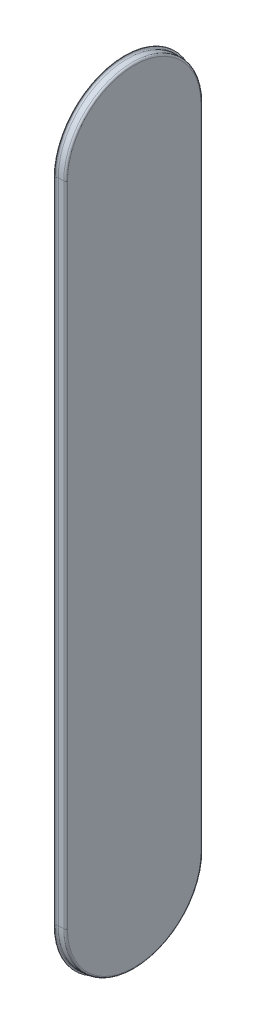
ISO-10303-21;
HEADER;
FILE_DESCRIPTION(('STEP AP214'),'2;1');
FILE_NAME('part.step','',(''),(''),'','','');
FILE_SCHEMA(('AUTOMOTIVE_DESIGN { 1 0 10303 214 1 1 1 1 }'));
ENDSEC;
DATA;
#1=APPLICATION_CONTEXT('core data for automotive mechanical design processes');
#2=APPLICATION_PROTOCOL_DEFINITION('international standard','automotive_design',2000,#1);
#3=PRODUCT_CONTEXT('',#1,'mechanical');
#4=PRODUCT('Part','Part','',(#3));
#5=PRODUCT_RELATED_PRODUCT_CATEGORY('part','',(#4));
#6=PRODUCT_DEFINITION_FORMATION('','',#4);
#7=PRODUCT_DEFINITION_CONTEXT('part definition',#1,'design');
#8=PRODUCT_DEFINITION('design','',#6,#7);
#9=PRODUCT_DEFINITION_SHAPE('','',#8);
#10=(LENGTH_UNIT() NAMED_UNIT(*) SI_UNIT(.MILLI.,.METRE.));
#11=(NAMED_UNIT(*) PLANE_ANGLE_UNIT() SI_UNIT($,.RADIAN.));
#12=(NAMED_UNIT(*) SI_UNIT($,.STERADIAN.) SOLID_ANGLE_UNIT());
#13=UNCERTAINTY_MEASURE_WITH_UNIT(LENGTH_MEASURE(1.E-05),#10,'distance_accuracy_value','');
#14=(GEOMETRIC_REPRESENTATION_CONTEXT(3) GLOBAL_UNCERTAINTY_ASSIGNED_CONTEXT((#13)) GLOBAL_UNIT_ASSIGNED_CONTEXT((#10,
#11,#12)) REPRESENTATION_CONTEXT('',''));
#15=CARTESIAN_POINT('',(0.,0.,0.));
#16=DIRECTION('',(0.,0.,1.));
#17=DIRECTION('',(1.,0.,0.));
#18=AXIS2_PLACEMENT_3D('',#15,#16,#17);
#19=CARTESIAN_POINT('',(-38.75,-31.965,3.99999999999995));
#20=DIRECTION('',(-1.,0.,0.));
#21=DIRECTION('',(0.,-1.,0.));
#22=AXIS2_PLACEMENT_3D('',#19,#20,#21);
#23=PLANE('',#22);
#24=DIRECTION('',(0.,1.,0.));
#25=VECTOR('',#24,1.);
#26=CARTESIAN_POINT('',(-38.75,-31.965,5.82499999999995));
#27=LINE('',#26,#25);
#28=CARTESIAN_POINT('',(-38.75,-31.965,5.82499999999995));
#29=VERTEX_POINT('',#28);
#30=CARTESIAN_POINT('',(-38.75,-14.265,5.82499999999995));
#31=VERTEX_POINT('',#30);
#32=EDGE_CURVE('E164',#29,#31,#27,.T.);
#33=ORIENTED_EDGE('',*,*,#32,.F.);
#34=CARTESIAN_POINT('',(-38.75,-31.965,3.99999999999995));
#35=DIRECTION('',(-1.,0.,0.));
#36=DIRECTION('',(0.,0.,-1.));
#37=AXIS2_PLACEMENT_3D('',#34,#35,#36);
#38=CIRCLE('',#37,1.825);
#39=CARTESIAN_POINT('',(-38.75,-31.965,2.17499999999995));
#40=VERTEX_POINT('',#39);
#41=EDGE_CURVE('E145',#40,#29,#38,.T.);
#42=ORIENTED_EDGE('',*,*,#41,.F.);
#43=DIRECTION('',(0.,-1.,0.));
#44=VECTOR('',#43,1.);
#45=CARTESIAN_POINT('',(-38.75,-31.965,2.17499999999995));
#46=LINE('',#45,#44);
#47=CARTESIAN_POINT('',(-38.75,-14.265,2.17499999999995));
#48=VERTEX_POINT('',#47);
#49=EDGE_CURVE('E144',#48,#40,#46,.T.);
#50=ORIENTED_EDGE('',*,*,#49,.F.);
#51=CARTESIAN_POINT('',(-38.75,-14.265,3.99999999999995));
#52=DIRECTION('',(-1.,0.,0.));
#53=DIRECTION('',(0.,0.,1.));
#54=AXIS2_PLACEMENT_3D('',#51,#52,#53);
#55=CIRCLE('',#54,1.825);
#56=EDGE_CURVE('E130',#31,#48,#55,.T.);
#57=ORIENTED_EDGE('',*,*,#56,.F.);
#58=EDGE_LOOP('',(#33,#42,#50,#57));
#59=FACE_BOUND('',#58,.T.);
#60=ADVANCED_FACE('F17',(#59),#23,.F.);
#61=CARTESIAN_POINT('',(-38.8,-14.265,3.99999999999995));
#62=DIRECTION('',(-1.,0.,0.));
#63=DIRECTION('',(0.,1.,0.));
#64=AXIS2_PLACEMENT_3D('',#61,#62,#63);
#65=TOROIDAL_SURFACE('',#64,1.825,0.05);
#66=CARTESIAN_POINT('',(-38.8,-14.265,2.17499999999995));
#67=DIRECTION('',(0.,-1.,0.));
#68=DIRECTION('',(1.,0.,0.));
#69=AXIS2_PLACEMENT_3D('',#66,#67,#68);
#70=CIRCLE('',#69,0.0500000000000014);
#71=CARTESIAN_POINT('',(-38.8,-14.265,2.12499999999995));
#72=VERTEX_POINT('',#71);
#73=EDGE_CURVE('E134',#72,#48,#70,.T.);
#74=ORIENTED_EDGE('',*,*,#73,.F.);
#75=CARTESIAN_POINT('',(-38.8,-14.265,3.99999999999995));
#76=DIRECTION('',(-1.,0.,0.));
#77=DIRECTION('',(0.,-1.,0.));
#78=AXIS2_PLACEMENT_3D('',#75,#76,#77);
#79=CIRCLE('',#78,1.875);
#80=CARTESIAN_POINT('',(-38.8,-14.265,5.87499999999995));
#81=VERTEX_POINT('',#80);
#82=EDGE_CURVE('E237',#81,#72,#79,.T.);
#83=ORIENTED_EDGE('',*,*,#82,.F.);
#84=CARTESIAN_POINT('',(-38.8,-14.265,5.82499999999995));
#85=DIRECTION('',(0.,1.,0.));
#86=DIRECTION('',(-1.,0.,0.));
#87=AXIS2_PLACEMENT_3D('',#84,#85,#86);
#88=CIRCLE('',#87,0.0500000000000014);
#89=EDGE_CURVE('E137',#31,#81,#88,.F.);
#90=ORIENTED_EDGE('',*,*,#89,.F.);
#91=ORIENTED_EDGE('',*,*,#56,.T.);
#92=EDGE_LOOP('',(#74,#83,#90,#91));
#93=FACE_BOUND('',#92,.T.);
#94=ADVANCED_FACE('F132',(#93),#65,.T.);
#95=CARTESIAN_POINT('',(-38.8,-31.965,2.17499999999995));
#96=DIRECTION('',(0.,-1.,0.));
#97=DIRECTION('',(1.,0.,0.));
#98=AXIS2_PLACEMENT_3D('',#95,#96,#97);
#99=CYLINDRICAL_SURFACE('',#98,0.0500000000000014);
#100=CARTESIAN_POINT('',(-38.8,-31.965,2.17499999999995));
#101=DIRECTION('',(0.,-1.,0.));
#102=DIRECTION('',(0.,0.,-1.));
#103=AXIS2_PLACEMENT_3D('',#100,#101,#102);
#104=CIRCLE('',#103,0.05);
#105=CARTESIAN_POINT('',(-38.8,-31.965,2.12499999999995));
#106=VERTEX_POINT('',#105);
#107=EDGE_CURVE('E183',#106,#40,#104,.T.);
#108=ORIENTED_EDGE('',*,*,#107,.F.);
#109=DIRECTION('',(0.,1.,0.));
#110=VECTOR('',#109,1.);
#111=CARTESIAN_POINT('',(-38.8,-31.965,2.12499999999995));
#112=LINE('',#111,#110);
#113=EDGE_CURVE('E153',#72,#106,#112,.F.);
#114=ORIENTED_EDGE('',*,*,#113,.F.);
#115=ORIENTED_EDGE('',*,*,#73,.T.);
#116=ORIENTED_EDGE('',*,*,#49,.T.);
#117=EDGE_LOOP('',(#108,#114,#115,#116));
#118=FACE_BOUND('',#117,.T.);
#119=ADVANCED_FACE('F151',(#118),#99,.T.);
#120=CARTESIAN_POINT('',(-38.8,-31.965,3.99999999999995));
#121=DIRECTION('',(-1.,0.,0.));
#122=DIRECTION('',(0.,-1.,0.));
#123=AXIS2_PLACEMENT_3D('',#120,#121,#122);
#124=TOROIDAL_SURFACE('',#123,1.825,0.05);
#125=CARTESIAN_POINT('',(-38.8,-31.965,3.99999999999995));
#126=DIRECTION('',(-1.,0.,0.));
#127=DIRECTION('',(0.,-1.,0.));
#128=AXIS2_PLACEMENT_3D('',#125,#126,#127);
#129=CIRCLE('',#128,1.875);
#130=CARTESIAN_POINT('',(-38.8,-31.965,5.87499999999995));
#131=VERTEX_POINT('',#130);
#132=EDGE_CURVE('E212',#106,#131,#129,.T.);
#133=ORIENTED_EDGE('',*,*,#132,.F.);
#134=ORIENTED_EDGE('',*,*,#107,.T.);
#135=ORIENTED_EDGE('',*,*,#41,.T.);
#136=CARTESIAN_POINT('',(-38.8,-31.965,5.82499999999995));
#137=DIRECTION('',(0.,1.,0.));
#138=DIRECTION('',(-1.,0.,0.));
#139=AXIS2_PLACEMENT_3D('',#136,#137,#138);
#140=CIRCLE('',#139,0.0500000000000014);
#141=EDGE_CURVE('E184',#131,#29,#140,.T.);
#142=ORIENTED_EDGE('',*,*,#141,.F.);
#143=EDGE_LOOP('',(#133,#134,#135,#142));
#144=FACE_BOUND('',#143,.T.);
#145=ADVANCED_FACE('F171',(#144),#124,.T.);
#146=CARTESIAN_POINT('',(-38.8,-31.965,5.82499999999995));
#147=DIRECTION('',(0.,1.,0.));
#148=DIRECTION('',(-1.,0.,0.));
#149=AXIS2_PLACEMENT_3D('',#146,#147,#148);
#150=CYLINDRICAL_SURFACE('',#149,0.0500000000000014);
#151=ORIENTED_EDGE('',*,*,#89,.T.);
#152=DIRECTION('',(0.,1.,0.));
#153=VECTOR('',#152,1.);
#154=CARTESIAN_POINT('',(-38.8,-31.965,5.87499999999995));
#155=LINE('',#154,#153);
#156=EDGE_CURVE('E194',#131,#81,#155,.T.);
#157=ORIENTED_EDGE('',*,*,#156,.F.);
#158=ORIENTED_EDGE('',*,*,#141,.T.);
#159=ORIENTED_EDGE('',*,*,#32,.T.);
#160=EDGE_LOOP('',(#151,#157,#158,#159));
#161=FACE_BOUND('',#160,.T.);
#162=ADVANCED_FACE('F176',(#161),#150,.T.);
#163=CARTESIAN_POINT('',(-38.75,-14.265,3.99999999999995));
#164=DIRECTION('',(-1.,0.,0.));
#165=DIRECTION('',(0.,-1.,0.));
#166=AXIS2_PLACEMENT_3D('',#163,#164,#165);
#167=CYLINDRICAL_SURFACE('',#166,1.875);
#168=DIRECTION('',(-1.,0.,0.));
#169=VECTOR('',#168,1.);
#170=CARTESIAN_POINT('',(-38.75,-14.265,2.12499999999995));
#171=LINE('',#170,#169);
#172=CARTESIAN_POINT('',(-38.95,-14.265,2.12499999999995));
#173=VERTEX_POINT('',#172);
#174=EDGE_CURVE('E235',#173,#72,#171,.F.);
#175=ORIENTED_EDGE('',*,*,#174,.F.);
#176=CARTESIAN_POINT('',(-38.95,-14.265,3.99999999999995));
#177=DIRECTION('',(-1.,0.,0.));
#178=DIRECTION('',(0.,1.,0.));
#179=AXIS2_PLACEMENT_3D('',#176,#177,#178);
#180=CIRCLE('',#179,1.875);
#181=CARTESIAN_POINT('',(-38.95,-14.265,5.87499999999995));
#182=VERTEX_POINT('',#181);
#183=EDGE_CURVE('E221',#173,#182,#180,.F.);
#184=ORIENTED_EDGE('',*,*,#183,.T.);
#185=DIRECTION('',(1.,0.,0.));
#186=VECTOR('',#185,1.);
#187=CARTESIAN_POINT('',(-38.75,-14.265,5.87499999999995));
#188=LINE('',#187,#186);
#189=EDGE_CURVE('E199',#81,#182,#188,.F.);
#190=ORIENTED_EDGE('',*,*,#189,.F.);
#191=ORIENTED_EDGE('',*,*,#82,.T.);
#192=EDGE_LOOP('',(#175,#184,#190,#191));
#193=FACE_BOUND('',#192,.T.);
#194=ADVANCED_FACE('F299',(#193),#167,.T.);
#195=CARTESIAN_POINT('',(-38.75,-31.965,2.12499999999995));
#196=DIRECTION('',(0.,0.,-1.));
#197=DIRECTION('',(-1.,0.,0.));
#198=AXIS2_PLACEMENT_3D('',#195,#196,#197);
#199=PLANE('',#198);
#200=DIRECTION('',(-1.,0.,0.));
#201=VECTOR('',#200,1.);
#202=CARTESIAN_POINT('',(-38.75,-31.965,2.12499999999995));
#203=LINE('',#202,#201);
#204=CARTESIAN_POINT('',(-38.95,-31.965,2.12499999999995));
#205=VERTEX_POINT('',#204);
#206=EDGE_CURVE('E209',#205,#106,#203,.F.);
#207=ORIENTED_EDGE('',*,*,#206,.F.);
#208=DIRECTION('',(0.,1.,0.));
#209=VECTOR('',#208,1.);
#210=CARTESIAN_POINT('',(-38.95,-31.965,2.12499999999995));
#211=LINE('',#210,#209);
#212=EDGE_CURVE('E225',#205,#173,#211,.T.);
#213=ORIENTED_EDGE('',*,*,#212,.T.);
#214=ORIENTED_EDGE('',*,*,#174,.T.);
#215=ORIENTED_EDGE('',*,*,#113,.T.);
#216=EDGE_LOOP('',(#207,#213,#214,#215));
#217=FACE_BOUND('',#216,.T.);
#218=ADVANCED_FACE('F253',(#217),#199,.T.);
#219=CARTESIAN_POINT('',(-38.75,-31.965,3.99999999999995));
#220=DIRECTION('',(-1.,0.,0.));
#221=DIRECTION('',(0.,-1.,0.));
#222=AXIS2_PLACEMENT_3D('',#219,#220,#221);
#223=CYLINDRICAL_SURFACE('',#222,1.875);
#224=CARTESIAN_POINT('',(-38.95,-31.965,3.99999999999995));
#225=DIRECTION('',(-1.,0.,0.));
#226=DIRECTION('',(0.,-1.,0.));
#227=AXIS2_PLACEMENT_3D('',#224,#225,#226);
#228=CIRCLE('',#227,1.875);
#229=CARTESIAN_POINT('',(-38.95,-31.965,5.87499999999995));
#230=VERTEX_POINT('',#229);
#231=EDGE_CURVE('E255',#230,#205,#228,.F.);
#232=ORIENTED_EDGE('',*,*,#231,.T.);
#233=ORIENTED_EDGE('',*,*,#206,.T.);
#234=ORIENTED_EDGE('',*,*,#132,.T.);
#235=DIRECTION('',(1.,0.,0.));
#236=VECTOR('',#235,1.);
#237=CARTESIAN_POINT('',(-38.75,-31.965,5.87499999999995));
#238=LINE('',#237,#236);
#239=EDGE_CURVE('E200',#230,#131,#238,.T.);
#240=ORIENTED_EDGE('',*,*,#239,.F.);
#241=EDGE_LOOP('',(#232,#233,#234,#240));
#242=FACE_BOUND('',#241,.T.);
#243=ADVANCED_FACE('F254',(#242),#223,.T.);
#244=CARTESIAN_POINT('',(-38.75,-31.965,5.87499999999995));
#245=DIRECTION('',(0.,0.,1.));
#246=DIRECTION('',(1.,0.,0.));
#247=AXIS2_PLACEMENT_3D('',#244,#245,#246);
#248=PLANE('',#247);
#249=ORIENTED_EDGE('',*,*,#189,.T.);
#250=DIRECTION('',(0.,-1.,0.));
#251=VECTOR('',#250,1.);
#252=CARTESIAN_POINT('',(-38.95,-31.965,5.87499999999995));
#253=LINE('',#252,#251);
#254=EDGE_CURVE('E205',#182,#230,#253,.T.);
#255=ORIENTED_EDGE('',*,*,#254,.T.);
#256=ORIENTED_EDGE('',*,*,#239,.T.);
#257=ORIENTED_EDGE('',*,*,#156,.T.);
#258=EDGE_LOOP('',(#249,#255,#256,#257));
#259=FACE_BOUND('',#258,.T.);
#260=ADVANCED_FACE('F203',(#259),#248,.T.);
#261=CARTESIAN_POINT('',(-38.95,-14.265,3.99999999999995));
#262=DIRECTION('',(-1.,0.,0.));
#263=DIRECTION('',(0.,1.,0.));
#264=AXIS2_PLACEMENT_3D('',#261,#262,#263);
#265=TOROIDAL_SURFACE('',#264,1.925,0.05);
#266=ORIENTED_EDGE('',*,*,#183,.F.);
#267=CARTESIAN_POINT('',(-38.95,-14.265,2.07499999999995));
#268=DIRECTION('',(0.,1.,0.));
#269=DIRECTION('',(-1.,0.,0.));
#270=AXIS2_PLACEMENT_3D('',#267,#268,#269);
#271=CIRCLE('',#270,0.0500000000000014);
#272=CARTESIAN_POINT('',(-39.,-14.265,2.07499999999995));
#273=VERTEX_POINT('',#272);
#274=EDGE_CURVE('E230',#173,#273,#271,.F.);
#275=ORIENTED_EDGE('',*,*,#274,.T.);
#276=CARTESIAN_POINT('',(-39.,-14.265,3.99999999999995));
#277=DIRECTION('',(-1.,0.,0.));
#278=DIRECTION('',(0.,-1.,0.));
#279=AXIS2_PLACEMENT_3D('',#276,#277,#278);
#280=CIRCLE('',#279,1.925);
#281=CARTESIAN_POINT('',(-39.,-14.265,5.92499999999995));
#282=VERTEX_POINT('',#281);
#283=EDGE_CURVE('E527',#282,#273,#280,.T.);
#284=ORIENTED_EDGE('',*,*,#283,.F.);
#285=CARTESIAN_POINT('',(-38.95,-14.265,5.92499999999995));
#286=DIRECTION('',(0.,-1.,0.));
#287=DIRECTION('',(1.,0.,0.));
#288=AXIS2_PLACEMENT_3D('',#285,#286,#287);
#289=CIRCLE('',#288,0.0500000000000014);
#290=EDGE_CURVE('E272',#282,#182,#289,.T.);
#291=ORIENTED_EDGE('',*,*,#290,.T.);
#292=EDGE_LOOP('',(#266,#275,#284,#291));
#293=FACE_BOUND('',#292,.T.);
#294=ADVANCED_FACE('F288',(#293),#265,.F.);
#295=CARTESIAN_POINT('',(-38.95,-31.965,2.07499999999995));
#296=DIRECTION('',(0.,1.,0.));
#297=DIRECTION('',(-1.,0.,0.));
#298=AXIS2_PLACEMENT_3D('',#295,#296,#297);
#299=CYLINDRICAL_SURFACE('',#298,0.0500000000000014);
#300=ORIENTED_EDGE('',*,*,#212,.F.);
#301=CARTESIAN_POINT('',(-38.95,-31.965,2.07499999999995));
#302=DIRECTION('',(0.,-1.,0.));
#303=DIRECTION('',(0.,0.,-1.));
#304=AXIS2_PLACEMENT_3D('',#301,#302,#303);
#305=CIRCLE('',#304,0.05);
#306=CARTESIAN_POINT('',(-39.,-31.965,2.07499999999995));
#307=VERTEX_POINT('',#306);
#308=EDGE_CURVE('E260',#205,#307,#305,.T.);
#309=ORIENTED_EDGE('',*,*,#308,.T.);
#310=DIRECTION('',(0.,1.,0.));
#311=VECTOR('',#310,1.);
#312=CARTESIAN_POINT('',(-39.,-23.115,2.07499999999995));
#313=LINE('',#312,#311);
#314=EDGE_CURVE('E524',#307,#273,#313,.T.);
#315=ORIENTED_EDGE('',*,*,#314,.T.);
#316=ORIENTED_EDGE('',*,*,#274,.F.);
#317=EDGE_LOOP('',(#300,#309,#315,#316));
#318=FACE_BOUND('',#317,.T.);
#319=ADVANCED_FACE('F264',(#318),#299,.F.);
#320=CARTESIAN_POINT('',(-38.95,-31.965,3.99999999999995));
#321=DIRECTION('',(-1.,0.,0.));
#322=DIRECTION('',(0.,-1.,0.));
#323=AXIS2_PLACEMENT_3D('',#320,#321,#322);
#324=TOROIDAL_SURFACE('',#323,1.925,0.05);
#325=ORIENTED_EDGE('',*,*,#308,.F.);
#326=ORIENTED_EDGE('',*,*,#231,.F.);
#327=CARTESIAN_POINT('',(-38.95,-31.965,5.92499999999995));
#328=DIRECTION('',(0.,-1.,0.));
#329=DIRECTION('',(1.,0.,0.));
#330=AXIS2_PLACEMENT_3D('',#327,#328,#329);
#331=CIRCLE('',#330,0.0500000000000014);
#332=CARTESIAN_POINT('',(-39.,-31.965,5.92499999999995));
#333=VERTEX_POINT('',#332);
#334=EDGE_CURVE('E530',#230,#333,#331,.F.);
#335=ORIENTED_EDGE('',*,*,#334,.T.);
#336=CARTESIAN_POINT('',(-39.,-31.965,3.99999999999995));
#337=DIRECTION('',(-1.,0.,0.));
#338=DIRECTION('',(0.,-1.,0.));
#339=AXIS2_PLACEMENT_3D('',#336,#337,#338);
#340=CIRCLE('',#339,1.925);
#341=EDGE_CURVE('E270',#307,#333,#340,.T.);
#342=ORIENTED_EDGE('',*,*,#341,.F.);
#343=EDGE_LOOP('',(#325,#326,#335,#342));
#344=FACE_BOUND('',#343,.T.);
#345=ADVANCED_FACE('F268',(#344),#324,.F.);
#346=CARTESIAN_POINT('',(-38.95,-31.965,5.92499999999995));
#347=DIRECTION('',(0.,-1.,0.));
#348=DIRECTION('',(1.,0.,0.));
#349=AXIS2_PLACEMENT_3D('',#346,#347,#348);
#350=CYLINDRICAL_SURFACE('',#349,0.0500000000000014);
#351=ORIENTED_EDGE('',*,*,#254,.F.);
#352=ORIENTED_EDGE('',*,*,#290,.F.);
#353=DIRECTION('',(0.,1.,0.));
#354=VECTOR('',#353,1.);
#355=CARTESIAN_POINT('',(-39.,-23.115,5.92499999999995));
#356=LINE('',#355,#354);
#357=EDGE_CURVE('E491',#282,#333,#356,.F.);
#358=ORIENTED_EDGE('',*,*,#357,.T.);
#359=ORIENTED_EDGE('',*,*,#334,.F.);
#360=EDGE_LOOP('',(#351,#352,#358,#359));
#361=FACE_BOUND('',#360,.T.);
#362=ADVANCED_FACE('F566',(#361),#350,.F.);
#363=CARTESIAN_POINT('',(-38.95,-14.265,3.99999999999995));
#364=DIRECTION('',(-1.,0.,0.));
#365=DIRECTION('',(0.,-1.,0.));
#366=AXIS2_PLACEMENT_3D('',#363,#364,#365);
#367=CYLINDRICAL_SURFACE('',#366,1.925);
#368=DIRECTION('',(1.,0.,0.));
#369=VECTOR('',#368,1.);
#370=CARTESIAN_POINT('',(-39.01,-14.265,2.07499999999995));
#371=LINE('',#370,#369);
#372=CARTESIAN_POINT('',(-39.01,-14.265,2.07499999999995));
#373=VERTEX_POINT('',#372);
#374=EDGE_CURVE('E522',#273,#373,#371,.F.);
#375=ORIENTED_EDGE('',*,*,#374,.T.);
#376=CARTESIAN_POINT('',(-39.01,-14.265,3.99999999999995));
#377=DIRECTION('',(-1.,0.,0.));
#378=DIRECTION('',(0.,1.,0.));
#379=AXIS2_PLACEMENT_3D('',#376,#377,#378);
#380=CIRCLE('',#379,1.925);
#381=CARTESIAN_POINT('',(-39.01,-14.265,5.92499999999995));
#382=VERTEX_POINT('',#381);
#383=EDGE_CURVE('E487',#382,#373,#380,.T.);
#384=ORIENTED_EDGE('',*,*,#383,.F.);
#385=DIRECTION('',(-1.,0.,0.));
#386=VECTOR('',#385,1.);
#387=CARTESIAN_POINT('',(-39.01,-14.265,5.92499999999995));
#388=LINE('',#387,#386);
#389=EDGE_CURVE('E498',#382,#282,#388,.F.);
#390=ORIENTED_EDGE('',*,*,#389,.T.);
#391=ORIENTED_EDGE('',*,*,#283,.T.);
#392=EDGE_LOOP('',(#375,#384,#390,#391));
#393=FACE_BOUND('',#392,.T.);
#394=ADVANCED_FACE('F549',(#393),#367,.T.);
#395=CARTESIAN_POINT('',(-39.01,-23.115,2.07499999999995));
#396=DIRECTION('',(0.,0.,1.));
#397=DIRECTION('',(1.,0.,0.));
#398=AXIS2_PLACEMENT_3D('',#395,#396,#397);
#399=PLANE('',#398);
#400=ORIENTED_EDGE('',*,*,#314,.F.);
#401=DIRECTION('',(-1.,0.,0.));
#402=VECTOR('',#401,1.);
#403=CARTESIAN_POINT('',(-38.95,-31.965,2.07499999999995));
#404=LINE('',#403,#402);
#405=CARTESIAN_POINT('',(-39.01,-31.965,2.07499999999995));
#406=VERTEX_POINT('',#405);
#407=EDGE_CURVE('E505',#406,#307,#404,.F.);
#408=ORIENTED_EDGE('',*,*,#407,.F.);
#409=DIRECTION('',(0.,1.,0.));
#410=VECTOR('',#409,1.);
#411=CARTESIAN_POINT('',(-39.01,-31.965,2.07499999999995));
#412=LINE('',#411,#410);
#413=EDGE_CURVE('E511',#373,#406,#412,.F.);
#414=ORIENTED_EDGE('',*,*,#413,.F.);
#415=ORIENTED_EDGE('',*,*,#374,.F.);
#416=EDGE_LOOP('',(#400,#408,#414,#415));
#417=FACE_BOUND('',#416,.T.);
#418=ADVANCED_FACE('F553',(#417),#399,.F.);
#419=CARTESIAN_POINT('',(-38.95,-31.965,3.99999999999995));
#420=DIRECTION('',(-1.,0.,0.));
#421=DIRECTION('',(0.,-1.,0.));
#422=AXIS2_PLACEMENT_3D('',#419,#420,#421);
#423=CYLINDRICAL_SURFACE('',#422,1.925);
#424=CARTESIAN_POINT('',(-39.01,-31.965,3.99999999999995));
#425=DIRECTION('',(-1.,0.,0.));
#426=DIRECTION('',(0.,-1.,0.));
#427=AXIS2_PLACEMENT_3D('',#424,#425,#426);
#428=CIRCLE('',#427,1.925);
#429=CARTESIAN_POINT('',(-39.01,-31.965,5.92499999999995));
#430=VERTEX_POINT('',#429);
#431=EDGE_CURVE('E508',#406,#430,#428,.T.);
#432=ORIENTED_EDGE('',*,*,#431,.F.);
#433=ORIENTED_EDGE('',*,*,#407,.T.);
#434=ORIENTED_EDGE('',*,*,#341,.T.);
#435=DIRECTION('',(-1.,0.,0.));
#436=VECTOR('',#435,1.);
#437=CARTESIAN_POINT('',(-39.01,-31.965,5.92499999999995));
#438=LINE('',#437,#436);
#439=EDGE_CURVE('E501',#333,#430,#438,.T.);
#440=ORIENTED_EDGE('',*,*,#439,.T.);
#441=EDGE_LOOP('',(#432,#433,#434,#440));
#442=FACE_BOUND('',#441,.T.);
#443=ADVANCED_FACE('F569',(#442),#423,.T.);
#444=CARTESIAN_POINT('',(-39.01,-23.115,5.92499999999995));
#445=DIRECTION('',(0.,0.,-1.));
#446=DIRECTION('',(-1.,0.,0.));
#447=AXIS2_PLACEMENT_3D('',#444,#445,#446);
#448=PLANE('',#447);
#449=ORIENTED_EDGE('',*,*,#389,.F.);
#450=DIRECTION('',(0.,-1.,0.));
#451=VECTOR('',#450,1.);
#452=CARTESIAN_POINT('',(-39.01,-31.965,5.92499999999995));
#453=LINE('',#452,#451);
#454=EDGE_CURVE('E443',#430,#382,#453,.F.);
#455=ORIENTED_EDGE('',*,*,#454,.F.);
#456=ORIENTED_EDGE('',*,*,#439,.F.);
#457=ORIENTED_EDGE('',*,*,#357,.F.);
#458=EDGE_LOOP('',(#449,#455,#456,#457));
#459=FACE_BOUND('',#458,.T.);
#460=ADVANCED_FACE('F479',(#459),#448,.F.);
#461=CARTESIAN_POINT('',(-38.95,-14.265,3.99999999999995));
#462=DIRECTION('',(-1.,0.,0.));
#463=DIRECTION('',(0.,1.,0.));
#464=AXIS2_PLACEMENT_3D('',#461,#462,#463);
#465=TOROIDAL_SURFACE('',#464,1.925,0.06);
#466=CARTESIAN_POINT('',(-38.95,-14.265,2.07499999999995));
#467=DIRECTION('',(0.,1.,0.));
#468=DIRECTION('',(-1.,0.,0.));
#469=AXIS2_PLACEMENT_3D('',#466,#467,#468);
#470=CIRCLE('',#469,0.0599999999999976);
#471=CARTESIAN_POINT('',(-38.95,-14.265,2.13499999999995));
#472=VERTEX_POINT('',#471);
#473=EDGE_CURVE('E490',#472,#373,#470,.F.);
#474=ORIENTED_EDGE('',*,*,#473,.F.);
#475=CARTESIAN_POINT('',(-38.95,-14.265,3.99999999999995));
#476=DIRECTION('',(-1.,0.,0.));
#477=DIRECTION('',(0.,-1.,0.));
#478=AXIS2_PLACEMENT_3D('',#475,#476,#477);
#479=CIRCLE('',#478,1.865);
#480=CARTESIAN_POINT('',(-38.95,-14.265,5.86499999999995));
#481=VERTEX_POINT('',#480);
#482=EDGE_CURVE('E450',#472,#481,#479,.F.);
#483=ORIENTED_EDGE('',*,*,#482,.T.);
#484=CARTESIAN_POINT('',(-38.95,-14.265,5.92499999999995));
#485=DIRECTION('',(0.,-1.,0.));
#486=DIRECTION('',(1.,0.,0.));
#487=AXIS2_PLACEMENT_3D('',#484,#485,#486);
#488=CIRCLE('',#487,0.0599999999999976);
#489=EDGE_CURVE('E447',#382,#481,#488,.T.);
#490=ORIENTED_EDGE('',*,*,#489,.F.);
#491=ORIENTED_EDGE('',*,*,#383,.T.);
#492=EDGE_LOOP('',(#474,#483,#490,#491));
#493=FACE_BOUND('',#492,.T.);
#494=ADVANCED_FACE('F474',(#493),#465,.T.);
#495=CARTESIAN_POINT('',(-38.95,-31.965,2.07499999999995));
#496=DIRECTION('',(0.,1.,0.));
#497=DIRECTION('',(-1.,0.,0.));
#498=AXIS2_PLACEMENT_3D('',#495,#496,#497);
#499=CYLINDRICAL_SURFACE('',#498,0.0599999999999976);
#500=CARTESIAN_POINT('',(-38.95,-31.965,2.07499999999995));
#501=DIRECTION('',(0.,-1.,0.));
#502=DIRECTION('',(0.,0.,-1.));
#503=AXIS2_PLACEMENT_3D('',#500,#501,#502);
#504=CIRCLE('',#503,0.06);
#505=CARTESIAN_POINT('',(-38.95,-31.965,2.13499999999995));
#506=VERTEX_POINT('',#505);
#507=EDGE_CURVE('E444',#506,#406,#504,.T.);
#508=ORIENTED_EDGE('',*,*,#507,.F.);
#509=DIRECTION('',(0.,1.,0.));
#510=VECTOR('',#509,1.);
#511=CARTESIAN_POINT('',(-38.95,-31.965,2.13499999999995));
#512=LINE('',#511,#510);
#513=EDGE_CURVE('E429',#506,#472,#512,.T.);
#514=ORIENTED_EDGE('',*,*,#513,.T.);
#515=ORIENTED_EDGE('',*,*,#473,.T.);
#516=ORIENTED_EDGE('',*,*,#413,.T.);
#517=EDGE_LOOP('',(#508,#514,#515,#516));
#518=FACE_BOUND('',#517,.T.);
#519=ADVANCED_FACE('F469',(#518),#499,.T.);
#520=CARTESIAN_POINT('',(-38.95,-31.965,3.99999999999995));
#521=DIRECTION('',(-1.,0.,0.));
#522=DIRECTION('',(0.,-1.,0.));
#523=AXIS2_PLACEMENT_3D('',#520,#521,#522);
#524=TOROIDAL_SURFACE('',#523,1.925,0.06);
#525=CARTESIAN_POINT('',(-38.95,-31.965,3.99999999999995));
#526=DIRECTION('',(-1.,0.,0.));
#527=DIRECTION('',(0.,-1.,0.));
#528=AXIS2_PLACEMENT_3D('',#525,#526,#527);
#529=CIRCLE('',#528,1.865);
#530=CARTESIAN_POINT('',(-38.95,-31.965,5.86499999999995));
#531=VERTEX_POINT('',#530);
#532=EDGE_CURVE('E424',#531,#506,#529,.F.);
#533=ORIENTED_EDGE('',*,*,#532,.T.);
#534=ORIENTED_EDGE('',*,*,#507,.T.);
#535=ORIENTED_EDGE('',*,*,#431,.T.);
#536=CARTESIAN_POINT('',(-38.95,-31.965,5.92499999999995));
#537=DIRECTION('',(0.,-1.,0.));
#538=DIRECTION('',(1.,0.,0.));
#539=AXIS2_PLACEMENT_3D('',#536,#537,#538);
#540=CIRCLE('',#539,0.0599999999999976);
#541=EDGE_CURVE('E440',#531,#430,#540,.F.);
#542=ORIENTED_EDGE('',*,*,#541,.F.);
#543=EDGE_LOOP('',(#533,#534,#535,#542));
#544=FACE_BOUND('',#543,.T.);
#545=ADVANCED_FACE('F464',(#544),#524,.T.);
#546=CARTESIAN_POINT('',(-38.95,-31.965,5.92499999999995));
#547=DIRECTION('',(0.,-1.,0.));
#548=DIRECTION('',(1.,0.,0.));
#549=AXIS2_PLACEMENT_3D('',#546,#547,#548);
#550=CYLINDRICAL_SURFACE('',#549,0.0599999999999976);
#551=ORIENTED_EDGE('',*,*,#489,.T.);
#552=DIRECTION('',(0.,1.,0.));
#553=VECTOR('',#552,1.);
#554=CARTESIAN_POINT('',(-38.95,-31.965,5.86499999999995));
#555=LINE('',#554,#553);
#556=EDGE_CURVE('E407',#481,#531,#555,.F.);
#557=ORIENTED_EDGE('',*,*,#556,.T.);
#558=ORIENTED_EDGE('',*,*,#541,.T.);
#559=ORIENTED_EDGE('',*,*,#454,.T.);
#560=EDGE_LOOP('',(#551,#557,#558,#559));
#561=FACE_BOUND('',#560,.T.);
#562=ADVANCED_FACE('F468',(#561),#550,.T.);
#563=CARTESIAN_POINT('',(-38.75,-14.265,3.99999999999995));
#564=DIRECTION('',(-1.,0.,0.));
#565=DIRECTION('',(0.,-1.,0.));
#566=AXIS2_PLACEMENT_3D('',#563,#564,#565);
#567=CYLINDRICAL_SURFACE('',#566,1.865);
#568=ORIENTED_EDGE('',*,*,#482,.F.);
#569=DIRECTION('',(-1.,0.,0.));
#570=VECTOR('',#569,1.);
#571=CARTESIAN_POINT('',(-38.75,-14.265,2.13499999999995));
#572=LINE('',#571,#570);
#573=CARTESIAN_POINT('',(-38.8,-14.265,2.13499999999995));
#574=VERTEX_POINT('',#573);
#575=EDGE_CURVE('E427',#472,#574,#572,.F.);
#576=ORIENTED_EDGE('',*,*,#575,.T.);
#577=CARTESIAN_POINT('',(-38.8,-14.265,3.99999999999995));
#578=DIRECTION('',(-1.,0.,0.));
#579=DIRECTION('',(0.,1.,0.));
#580=AXIS2_PLACEMENT_3D('',#577,#578,#579);
#581=CIRCLE('',#580,1.865);
#582=CARTESIAN_POINT('',(-38.8,-14.265,5.86499999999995));
#583=VERTEX_POINT('',#582);
#584=EDGE_CURVE('E406',#574,#583,#581,.F.);
#585=ORIENTED_EDGE('',*,*,#584,.T.);
#586=DIRECTION('',(1.,0.,0.));
#587=VECTOR('',#586,1.);
#588=CARTESIAN_POINT('',(-38.75,-14.265,5.86499999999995));
#589=LINE('',#588,#587);
#590=EDGE_CURVE('E410',#583,#481,#589,.F.);
#591=ORIENTED_EDGE('',*,*,#590,.T.);
#592=EDGE_LOOP('',(#568,#576,#585,#591));
#593=FACE_BOUND('',#592,.T.);
#594=ADVANCED_FACE('F591',(#593),#567,.F.);
#595=CARTESIAN_POINT('',(-38.75,-31.965,2.13499999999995));
#596=DIRECTION('',(0.,0.,-1.));
#597=DIRECTION('',(-1.,0.,0.));
#598=AXIS2_PLACEMENT_3D('',#595,#596,#597);
#599=PLANE('',#598);
#600=ORIENTED_EDGE('',*,*,#513,.F.);
#601=DIRECTION('',(-1.,0.,0.));
#602=VECTOR('',#601,1.);
#603=CARTESIAN_POINT('',(-38.75,-31.965,2.13499999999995));
#604=LINE('',#603,#602);
#605=CARTESIAN_POINT('',(-38.8,-31.965,2.13499999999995));
#606=VERTEX_POINT('',#605);
#607=EDGE_CURVE('E413',#506,#606,#604,.F.);
#608=ORIENTED_EDGE('',*,*,#607,.T.);
#609=DIRECTION('',(0.,-1.,0.));
#610=VECTOR('',#609,1.);
#611=CARTESIAN_POINT('',(-38.8,-31.965,2.13499999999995));
#612=LINE('',#611,#610);
#613=EDGE_CURVE('E375',#606,#574,#612,.F.);
#614=ORIENTED_EDGE('',*,*,#613,.T.);
#615=ORIENTED_EDGE('',*,*,#575,.F.);
#616=EDGE_LOOP('',(#600,#608,#614,#615));
#617=FACE_BOUND('',#616,.T.);
#618=ADVANCED_FACE('F576',(#617),#599,.F.);
#619=CARTESIAN_POINT('',(-38.75,-31.965,3.99999999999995));
#620=DIRECTION('',(-1.,0.,0.));
#621=DIRECTION('',(0.,-1.,0.));
#622=AXIS2_PLACEMENT_3D('',#619,#620,#621);
#623=CYLINDRICAL_SURFACE('',#622,1.865);
#624=ORIENTED_EDGE('',*,*,#607,.F.);
#625=ORIENTED_EDGE('',*,*,#532,.F.);
#626=DIRECTION('',(1.,0.,0.));
#627=VECTOR('',#626,1.);
#628=CARTESIAN_POINT('',(-38.75,-31.965,5.86499999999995));
#629=LINE('',#628,#627);
#630=CARTESIAN_POINT('',(-38.8,-31.965,5.86499999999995));
#631=VERTEX_POINT('',#630);
#632=EDGE_CURVE('E404',#531,#631,#629,.T.);
#633=ORIENTED_EDGE('',*,*,#632,.T.);
#634=CARTESIAN_POINT('',(-38.8,-31.965,3.99999999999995));
#635=DIRECTION('',(-1.,0.,0.));
#636=DIRECTION('',(0.,-1.,0.));
#637=AXIS2_PLACEMENT_3D('',#634,#635,#636);
#638=CIRCLE('',#637,1.865);
#639=EDGE_CURVE('E370',#631,#606,#638,.F.);
#640=ORIENTED_EDGE('',*,*,#639,.T.);
#641=EDGE_LOOP('',(#624,#625,#633,#640));
#642=FACE_BOUND('',#641,.T.);
#643=ADVANCED_FACE('F577',(#642),#623,.F.);
#644=CARTESIAN_POINT('',(-38.75,-31.965,5.86499999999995));
#645=DIRECTION('',(0.,0.,1.));
#646=DIRECTION('',(1.,0.,0.));
#647=AXIS2_PLACEMENT_3D('',#644,#645,#646);
#648=PLANE('',#647);
#649=ORIENTED_EDGE('',*,*,#556,.F.);
#650=ORIENTED_EDGE('',*,*,#590,.F.);
#651=DIRECTION('',(0.,1.,0.));
#652=VECTOR('',#651,1.);
#653=CARTESIAN_POINT('',(-38.8,-31.965,5.86499999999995));
#654=LINE('',#653,#652);
#655=EDGE_CURVE('E344',#583,#631,#654,.F.);
#656=ORIENTED_EDGE('',*,*,#655,.T.);
#657=ORIENTED_EDGE('',*,*,#632,.F.);
#658=EDGE_LOOP('',(#649,#650,#656,#657));
#659=FACE_BOUND('',#658,.T.);
#660=ADVANCED_FACE('F385',(#659),#648,.F.);
#661=CARTESIAN_POINT('',(-38.8,-14.265,3.99999999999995));
#662=DIRECTION('',(-1.,0.,0.));
#663=DIRECTION('',(0.,1.,0.));
#664=AXIS2_PLACEMENT_3D('',#661,#662,#663);
#665=TOROIDAL_SURFACE('',#664,1.825,0.04);
#666=ORIENTED_EDGE('',*,*,#584,.F.);
#667=CARTESIAN_POINT('',(-38.8,-14.265,2.17499999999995));
#668=DIRECTION('',(0.,-1.,0.));
#669=DIRECTION('',(1.,0.,0.));
#670=AXIS2_PLACEMENT_3D('',#667,#668,#669);
#671=CIRCLE('',#670,0.0399999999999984);
#672=CARTESIAN_POINT('',(-38.76,-14.265,2.17499999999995));
#673=VERTEX_POINT('',#672);
#674=EDGE_CURVE('E373',#574,#673,#671,.T.);
#675=ORIENTED_EDGE('',*,*,#674,.T.);
#676=CARTESIAN_POINT('',(-38.76,-14.265,3.99999999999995));
#677=DIRECTION('',(1.,0.,0.));
#678=DIRECTION('',(0.,0.,-1.));
#679=AXIS2_PLACEMENT_3D('',#676,#677,#678);
#680=CIRCLE('',#679,1.825);
#681=CARTESIAN_POINT('',(-38.76,-14.265,5.82499999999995));
#682=VERTEX_POINT('',#681);
#683=EDGE_CURVE('E340',#682,#673,#680,.F.);
#684=ORIENTED_EDGE('',*,*,#683,.F.);
#685=CARTESIAN_POINT('',(-38.8,-14.265,5.82499999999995));
#686=DIRECTION('',(0.,1.,0.));
#687=DIRECTION('',(-1.,0.,0.));
#688=AXIS2_PLACEMENT_3D('',#685,#686,#687);
#689=CIRCLE('',#688,0.0399999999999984);
#690=EDGE_CURVE('E347',#682,#583,#689,.F.);
#691=ORIENTED_EDGE('',*,*,#690,.T.);
#692=EDGE_LOOP('',(#666,#675,#684,#691));
#693=FACE_BOUND('',#692,.T.);
#694=ADVANCED_FACE('F381',(#693),#665,.F.);
#695=CARTESIAN_POINT('',(-38.8,-31.965,2.17499999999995));
#696=DIRECTION('',(0.,-1.,0.));
#697=DIRECTION('',(1.,0.,0.));
#698=AXIS2_PLACEMENT_3D('',#695,#696,#697);
#699=CYLINDRICAL_SURFACE('',#698,0.0399999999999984);
#700=ORIENTED_EDGE('',*,*,#613,.F.);
#701=CARTESIAN_POINT('',(-38.8,-31.965,2.17499999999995));
#702=DIRECTION('',(0.,-1.,0.));
#703=DIRECTION('',(0.,0.,-1.));
#704=AXIS2_PLACEMENT_3D('',#701,#702,#703);
#705=CIRCLE('',#704,0.04);
#706=CARTESIAN_POINT('',(-38.76,-31.965,2.17499999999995));
#707=VERTEX_POINT('',#706);
#708=EDGE_CURVE('E350',#606,#707,#705,.T.);
#709=ORIENTED_EDGE('',*,*,#708,.T.);
#710=DIRECTION('',(0.,-1.,0.));
#711=VECTOR('',#710,1.);
#712=CARTESIAN_POINT('',(-38.76,-31.965,2.17499999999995));
#713=LINE('',#712,#711);
#714=EDGE_CURVE('E337',#673,#707,#713,.T.);
#715=ORIENTED_EDGE('',*,*,#714,.F.);
#716=ORIENTED_EDGE('',*,*,#674,.F.);
#717=EDGE_LOOP('',(#700,#709,#715,#716));
#718=FACE_BOUND('',#717,.T.);
#719=ADVANCED_FACE('F359',(#718),#699,.F.);
#720=CARTESIAN_POINT('',(-38.8,-31.965,3.99999999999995));
#721=DIRECTION('',(-1.,0.,0.));
#722=DIRECTION('',(0.,-1.,0.));
#723=AXIS2_PLACEMENT_3D('',#720,#721,#722);
#724=TOROIDAL_SURFACE('',#723,1.825,0.04);
#725=ORIENTED_EDGE('',*,*,#708,.F.);
#726=ORIENTED_EDGE('',*,*,#639,.F.);
#727=CARTESIAN_POINT('',(-38.8,-31.965,5.82499999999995));
#728=DIRECTION('',(0.,1.,0.));
#729=DIRECTION('',(-1.,0.,0.));
#730=AXIS2_PLACEMENT_3D('',#727,#728,#729);
#731=CIRCLE('',#730,0.0399999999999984);
#732=CARTESIAN_POINT('',(-38.76,-31.965,5.82499999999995));
#733=VERTEX_POINT('',#732);
#734=EDGE_CURVE('E37',#631,#733,#731,.T.);
#735=ORIENTED_EDGE('',*,*,#734,.T.);
#736=CARTESIAN_POINT('',(-38.76,-31.965,3.99999999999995));
#737=DIRECTION('',(1.,0.,0.));
#738=DIRECTION('',(0.,0.,1.));
#739=AXIS2_PLACEMENT_3D('',#736,#737,#738);
#740=CIRCLE('',#739,1.825);
#741=EDGE_CURVE('E28',#707,#733,#740,.F.);
#742=ORIENTED_EDGE('',*,*,#741,.F.);
#743=EDGE_LOOP('',(#725,#726,#735,#742));
#744=FACE_BOUND('',#743,.T.);
#745=ADVANCED_FACE('F314',(#744),#724,.F.);
#746=CARTESIAN_POINT('',(-38.8,-31.965,5.82499999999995));
#747=DIRECTION('',(0.,1.,0.));
#748=DIRECTION('',(-1.,0.,0.));
#749=AXIS2_PLACEMENT_3D('',#746,#747,#748);
#750=CYLINDRICAL_SURFACE('',#749,0.0399999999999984);
#751=ORIENTED_EDGE('',*,*,#655,.F.);
#752=ORIENTED_EDGE('',*,*,#690,.F.);
#753=DIRECTION('',(0.,-1.,0.));
#754=VECTOR('',#753,1.);
#755=CARTESIAN_POINT('',(-38.76,-31.965,5.82499999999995));
#756=LINE('',#755,#754);
#757=EDGE_CURVE('E11',#733,#682,#756,.F.);
#758=ORIENTED_EDGE('',*,*,#757,.F.);
#759=ORIENTED_EDGE('',*,*,#734,.F.);
#760=EDGE_LOOP('',(#751,#752,#758,#759));
#761=FACE_BOUND('',#760,.T.);
#762=ADVANCED_FACE('F308',(#761),#750,.F.);
#763=CARTESIAN_POINT('',(-38.76,-31.965,3.99999999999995));
#764=DIRECTION('',(-1.,0.,0.));
#765=DIRECTION('',(0.,-1.,0.));
#766=AXIS2_PLACEMENT_3D('',#763,#764,#765);
#767=PLANE('',#766);
#768=ORIENTED_EDGE('',*,*,#741,.T.);
#769=ORIENTED_EDGE('',*,*,#757,.T.);
#770=ORIENTED_EDGE('',*,*,#683,.T.);
#771=ORIENTED_EDGE('',*,*,#714,.T.);
#772=EDGE_LOOP('',(#768,#769,#770,#771));
#773=FACE_BOUND('',#772,.T.);
#774=ADVANCED_FACE('F306',(#773),#767,.T.);
#775=CLOSED_SHELL('',(#60,#94,#119,#145,#162,#194,#218,#243,#260,#294,#319,#345,#362,#394,#418,
#443,#460,#494,#519,#545,#562,#594,#618,#643,#660,#694,#719,#745,#762,#774));
#776=MANIFOLD_SOLID_BREP('B1',#775);
#777=ADVANCED_BREP_SHAPE_REPRESENTATION('',(#18,#776),#14);
#778=SHAPE_DEFINITION_REPRESENTATION(#9,#777);
ENDSEC;
END-ISO-10303-21;
